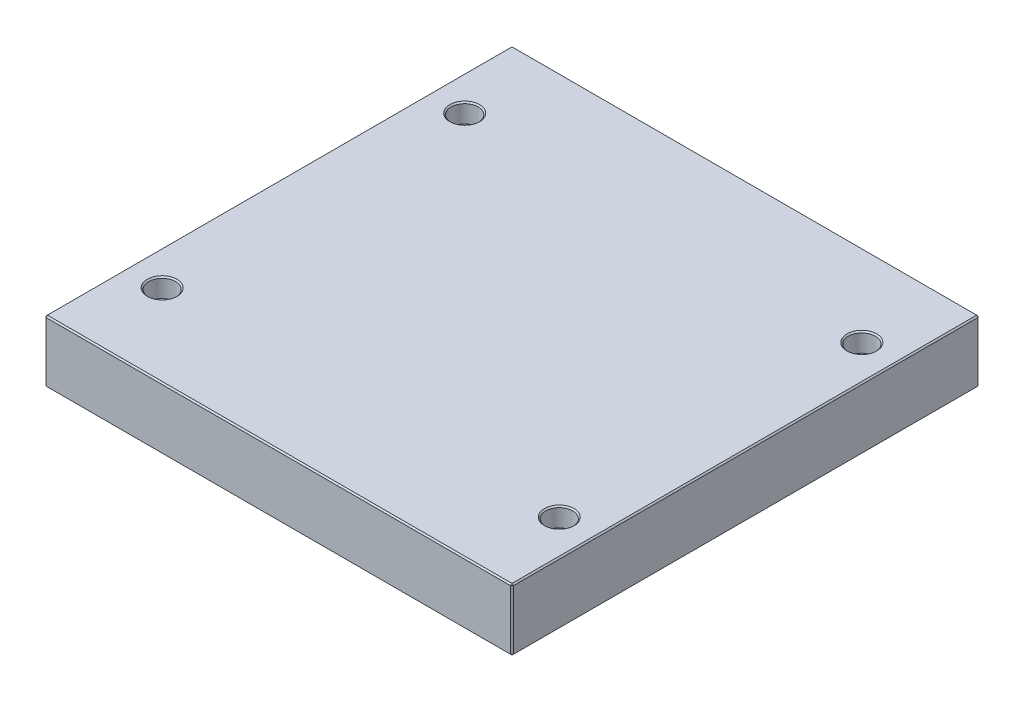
ISO-10303-21;
HEADER;
FILE_DESCRIPTION(('STEP AP214'),'2;1');
FILE_NAME('part.step','',(''),(''),'','','');
FILE_SCHEMA(('AUTOMOTIVE_DESIGN { 1 0 10303 214 1 1 1 1 }'));
ENDSEC;
DATA;
#1=APPLICATION_CONTEXT('core data for automotive mechanical design processes');
#2=APPLICATION_PROTOCOL_DEFINITION('international standard','automotive_design',2000,#1);
#3=PRODUCT_CONTEXT('',#1,'mechanical');
#4=PRODUCT('Part','Part','',(#3));
#5=PRODUCT_RELATED_PRODUCT_CATEGORY('part','',(#4));
#6=PRODUCT_DEFINITION_FORMATION('','',#4);
#7=PRODUCT_DEFINITION_CONTEXT('part definition',#1,'design');
#8=PRODUCT_DEFINITION('design','',#6,#7);
#9=PRODUCT_DEFINITION_SHAPE('','',#8);
#10=(LENGTH_UNIT() NAMED_UNIT(*) SI_UNIT(.MILLI.,.METRE.));
#11=(NAMED_UNIT(*) PLANE_ANGLE_UNIT() SI_UNIT($,.RADIAN.));
#12=(NAMED_UNIT(*) SI_UNIT($,.STERADIAN.) SOLID_ANGLE_UNIT());
#13=UNCERTAINTY_MEASURE_WITH_UNIT(LENGTH_MEASURE(1.E-05),#10,'distance_accuracy_value','');
#14=(GEOMETRIC_REPRESENTATION_CONTEXT(3) GLOBAL_UNCERTAINTY_ASSIGNED_CONTEXT((#13)) GLOBAL_UNIT_ASSIGNED_CONTEXT((#10,
#11,#12)) REPRESENTATION_CONTEXT('',''));
#15=CARTESIAN_POINT('',(0.,0.,0.));
#16=DIRECTION('',(0.,0.,1.));
#17=DIRECTION('',(1.,0.,0.));
#18=AXIS2_PLACEMENT_3D('',#15,#16,#17);
#19=CARTESIAN_POINT('',(-173.,46.,173.));
#20=DIRECTION('',(1.,0.,0.));
#21=DIRECTION('',(0.,0.,-1.));
#22=AXIS2_PLACEMENT_3D('',#19,#20,#21);
#23=PLANE('',#22);
#24=DIRECTION('',(0.,-1.,0.));
#25=VECTOR('',#24,1.);
#26=CARTESIAN_POINT('',(-173.,46.,-172.));
#27=LINE('',#26,#25);
#28=CARTESIAN_POINT('',(-173.,45.,-172.));
#29=VERTEX_POINT('',#28);
#30=CARTESIAN_POINT('',(-173.,1.,-172.));
#31=VERTEX_POINT('',#30);
#32=EDGE_CURVE('E115',#29,#31,#27,.T.);
#33=ORIENTED_EDGE('',*,*,#32,.T.);
#34=DIRECTION('',(0.,0.,1.));
#35=VECTOR('',#34,1.);
#36=CARTESIAN_POINT('',(-173.,1.,173.));
#37=LINE('',#36,#35);
#38=CARTESIAN_POINT('',(-173.,1.,172.));
#39=VERTEX_POINT('',#38);
#40=EDGE_CURVE('E111',#31,#39,#37,.T.);
#41=ORIENTED_EDGE('',*,*,#40,.T.);
#42=DIRECTION('',(0.,1.,0.));
#43=VECTOR('',#42,1.);
#44=CARTESIAN_POINT('',(-173.,46.,172.));
#45=LINE('',#44,#43);
#46=CARTESIAN_POINT('',(-173.,45.,172.));
#47=VERTEX_POINT('',#46);
#48=EDGE_CURVE('E104',#39,#47,#45,.T.);
#49=ORIENTED_EDGE('',*,*,#48,.T.);
#50=DIRECTION('',(0.,0.,-1.));
#51=VECTOR('',#50,1.);
#52=CARTESIAN_POINT('',(-173.,45.,-173.));
#53=LINE('',#52,#51);
#54=EDGE_CURVE('E108',#47,#29,#53,.T.);
#55=ORIENTED_EDGE('',*,*,#54,.T.);
#56=EDGE_LOOP('',(#33,#41,#49,#55));
#57=FACE_BOUND('',#56,.T.);
#58=ADVANCED_FACE('F16',(#57),#23,.F.);
#59=CARTESIAN_POINT('',(173.,46.,173.));
#60=DIRECTION('',(0.,0.,-1.));
#61=DIRECTION('',(-1.,0.,0.));
#62=AXIS2_PLACEMENT_3D('',#59,#60,#61);
#63=PLANE('',#62);
#64=DIRECTION('',(-1.,0.,0.));
#65=VECTOR('',#64,1.);
#66=CARTESIAN_POINT('',(-173.,45.,173.));
#67=LINE('',#66,#65);
#68=CARTESIAN_POINT('',(172.,45.,173.));
#69=VERTEX_POINT('',#68);
#70=CARTESIAN_POINT('',(-172.,45.,173.));
#71=VERTEX_POINT('',#70);
#72=EDGE_CURVE('E170',#69,#71,#67,.T.);
#73=ORIENTED_EDGE('',*,*,#72,.T.);
#74=DIRECTION('',(0.,-1.,0.));
#75=VECTOR('',#74,1.);
#76=CARTESIAN_POINT('',(-172.,46.,173.));
#77=LINE('',#76,#75);
#78=CARTESIAN_POINT('',(-172.,1.,173.));
#79=VERTEX_POINT('',#78);
#80=EDGE_CURVE('E123',#71,#79,#77,.T.);
#81=ORIENTED_EDGE('',*,*,#80,.T.);
#82=DIRECTION('',(1.,0.,0.));
#83=VECTOR('',#82,1.);
#84=CARTESIAN_POINT('',(173.,1.,173.));
#85=LINE('',#84,#83);
#86=CARTESIAN_POINT('',(172.,1.,173.));
#87=VERTEX_POINT('',#86);
#88=EDGE_CURVE('E174',#79,#87,#85,.T.);
#89=ORIENTED_EDGE('',*,*,#88,.T.);
#90=DIRECTION('',(0.,1.,0.));
#91=VECTOR('',#90,1.);
#92=CARTESIAN_POINT('',(172.,46.,173.));
#93=LINE('',#92,#91);
#94=EDGE_CURVE('E172',#87,#69,#93,.T.);
#95=ORIENTED_EDGE('',*,*,#94,.T.);
#96=EDGE_LOOP('',(#73,#81,#89,#95));
#97=FACE_BOUND('',#96,.T.);
#98=ADVANCED_FACE('F317',(#97),#63,.F.);
#99=CARTESIAN_POINT('',(173.,46.,173.));
#100=DIRECTION('',(-1.,0.,0.));
#101=DIRECTION('',(0.,0.,1.));
#102=AXIS2_PLACEMENT_3D('',#99,#100,#101);
#103=PLANE('',#102);
#104=DIRECTION('',(0.,0.,-1.));
#105=VECTOR('',#104,1.);
#106=CARTESIAN_POINT('',(173.,1.,173.));
#107=LINE('',#106,#105);
#108=CARTESIAN_POINT('',(173.,1.,172.));
#109=VERTEX_POINT('',#108);
#110=CARTESIAN_POINT('',(173.,1.,-172.));
#111=VERTEX_POINT('',#110);
#112=EDGE_CURVE('E165',#109,#111,#107,.T.);
#113=ORIENTED_EDGE('',*,*,#112,.T.);
#114=DIRECTION('',(0.,1.,0.));
#115=VECTOR('',#114,1.);
#116=CARTESIAN_POINT('',(173.,46.,-172.));
#117=LINE('',#116,#115);
#118=CARTESIAN_POINT('',(173.,45.,-172.));
#119=VERTEX_POINT('',#118);
#120=EDGE_CURVE('E167',#111,#119,#117,.T.);
#121=ORIENTED_EDGE('',*,*,#120,.T.);
#122=DIRECTION('',(0.,0.,1.));
#123=VECTOR('',#122,1.);
#124=CARTESIAN_POINT('',(173.,45.,173.));
#125=LINE('',#124,#123);
#126=CARTESIAN_POINT('',(173.,45.,172.));
#127=VERTEX_POINT('',#126);
#128=EDGE_CURVE('E161',#119,#127,#125,.T.);
#129=ORIENTED_EDGE('',*,*,#128,.T.);
#130=DIRECTION('',(0.,-1.,0.));
#131=VECTOR('',#130,1.);
#132=CARTESIAN_POINT('',(173.,46.,172.));
#133=LINE('',#132,#131);
#134=EDGE_CURVE('E163',#127,#109,#133,.T.);
#135=ORIENTED_EDGE('',*,*,#134,.T.);
#136=EDGE_LOOP('',(#113,#121,#129,#135));
#137=FACE_BOUND('',#136,.T.);
#138=ADVANCED_FACE('F323',(#137),#103,.F.);
#139=CARTESIAN_POINT('',(173.,46.,-173.));
#140=DIRECTION('',(0.,0.,1.));
#141=DIRECTION('',(1.,0.,0.));
#142=AXIS2_PLACEMENT_3D('',#139,#140,#141);
#143=PLANE('',#142);
#144=DIRECTION('',(0.,-1.,0.));
#145=VECTOR('',#144,1.);
#146=CARTESIAN_POINT('',(172.,46.,-173.));
#147=LINE('',#146,#145);
#148=CARTESIAN_POINT('',(172.,45.,-173.));
#149=VERTEX_POINT('',#148);
#150=CARTESIAN_POINT('',(172.,1.,-173.));
#151=VERTEX_POINT('',#150);
#152=EDGE_CURVE('E154',#149,#151,#147,.T.);
#153=ORIENTED_EDGE('',*,*,#152,.T.);
#154=DIRECTION('',(-1.,0.,0.));
#155=VECTOR('',#154,1.);
#156=CARTESIAN_POINT('',(173.,1.,-173.));
#157=LINE('',#156,#155);
#158=CARTESIAN_POINT('',(-172.,1.,-173.));
#159=VERTEX_POINT('',#158);
#160=EDGE_CURVE('E159',#151,#159,#157,.T.);
#161=ORIENTED_EDGE('',*,*,#160,.T.);
#162=DIRECTION('',(0.,1.,0.));
#163=VECTOR('',#162,1.);
#164=CARTESIAN_POINT('',(-172.,46.,-173.));
#165=LINE('',#164,#163);
#166=CARTESIAN_POINT('',(-172.,45.,-173.));
#167=VERTEX_POINT('',#166);
#168=EDGE_CURVE('E156',#159,#167,#165,.T.);
#169=ORIENTED_EDGE('',*,*,#168,.T.);
#170=DIRECTION('',(1.,0.,0.));
#171=VECTOR('',#170,1.);
#172=CARTESIAN_POINT('',(173.,45.,-173.));
#173=LINE('',#172,#171);
#174=EDGE_CURVE('E152',#167,#149,#173,.T.);
#175=ORIENTED_EDGE('',*,*,#174,.T.);
#176=EDGE_LOOP('',(#153,#161,#169,#175));
#177=FACE_BOUND('',#176,.T.);
#178=ADVANCED_FACE('F465',(#177),#143,.F.);
#179=CARTESIAN_POINT('',(0.,46.,0.));
#180=DIRECTION('',(0.,1.,0.));
#181=DIRECTION('',(0.,0.,1.));
#182=AXIS2_PLACEMENT_3D('',#179,#180,#181);
#183=PLANE('',#182);
#184=CARTESIAN_POINT('',(-147.,46.,112.));
#185=DIRECTION('',(0.,1.,0.));
#186=DIRECTION('',(0.,0.,1.));
#187=AXIS2_PLACEMENT_3D('',#184,#185,#186);
#188=CIRCLE('',#187,11.);
#189=CARTESIAN_POINT('',(-147.,46.,123.));
#190=VERTEX_POINT('',#189);
#191=EDGE_CURVE('E290',#190,#190,#188,.F.);
#192=ORIENTED_EDGE('',*,*,#191,.T.);
#193=EDGE_LOOP('',(#192));
#194=FACE_BOUND('',#193,.T.);
#195=CARTESIAN_POINT('',(147.,46.,112.));
#196=DIRECTION('',(0.,1.,0.));
#197=DIRECTION('',(0.,0.,1.));
#198=AXIS2_PLACEMENT_3D('',#195,#196,#197);
#199=CIRCLE('',#198,11.);
#200=CARTESIAN_POINT('',(147.,46.,123.));
#201=VERTEX_POINT('',#200);
#202=EDGE_CURVE('E287',#201,#201,#199,.F.);
#203=ORIENTED_EDGE('',*,*,#202,.T.);
#204=EDGE_LOOP('',(#203));
#205=FACE_BOUND('',#204,.T.);
#206=CARTESIAN_POINT('',(147.,46.,-112.));
#207=DIRECTION('',(0.,1.,0.));
#208=DIRECTION('',(0.,0.,1.));
#209=AXIS2_PLACEMENT_3D('',#206,#207,#208);
#210=CIRCLE('',#209,11.);
#211=CARTESIAN_POINT('',(147.,46.,-101.));
#212=VERTEX_POINT('',#211);
#213=EDGE_CURVE('E284',#212,#212,#210,.F.);
#214=ORIENTED_EDGE('',*,*,#213,.T.);
#215=EDGE_LOOP('',(#214));
#216=FACE_BOUND('',#215,.T.);
#217=CARTESIAN_POINT('',(-147.,46.,-112.));
#218=DIRECTION('',(0.,1.,0.));
#219=DIRECTION('',(0.,0.,1.));
#220=AXIS2_PLACEMENT_3D('',#217,#218,#219);
#221=CIRCLE('',#220,11.);
#222=CARTESIAN_POINT('',(-147.,46.,-101.));
#223=VERTEX_POINT('',#222);
#224=EDGE_CURVE('E281',#223,#223,#221,.F.);
#225=ORIENTED_EDGE('',*,*,#224,.T.);
#226=EDGE_LOOP('',(#225));
#227=FACE_BOUND('',#226,.T.);
#228=DIRECTION('',(0.,0.,-1.));
#229=VECTOR('',#228,1.);
#230=CARTESIAN_POINT('',(172.,46.,-173.));
#231=LINE('',#230,#229);
#232=CARTESIAN_POINT('',(172.,46.,172.));
#233=VERTEX_POINT('',#232);
#234=CARTESIAN_POINT('',(172.,46.,-172.));
#235=VERTEX_POINT('',#234);
#236=EDGE_CURVE('E31',#233,#235,#231,.T.);
#237=ORIENTED_EDGE('',*,*,#236,.T.);
#238=DIRECTION('',(-1.,0.,0.));
#239=VECTOR('',#238,1.);
#240=CARTESIAN_POINT('',(-173.,46.,-172.));
#241=LINE('',#240,#239);
#242=CARTESIAN_POINT('',(-172.,46.,-172.));
#243=VERTEX_POINT('',#242);
#244=EDGE_CURVE('E190',#235,#243,#241,.T.);
#245=ORIENTED_EDGE('',*,*,#244,.T.);
#246=DIRECTION('',(0.,0.,1.));
#247=VECTOR('',#246,1.);
#248=CARTESIAN_POINT('',(-172.,46.,173.));
#249=LINE('',#248,#247);
#250=CARTESIAN_POINT('',(-172.,46.,172.));
#251=VERTEX_POINT('',#250);
#252=EDGE_CURVE('E186',#243,#251,#249,.T.);
#253=ORIENTED_EDGE('',*,*,#252,.T.);
#254=DIRECTION('',(1.,0.,0.));
#255=VECTOR('',#254,1.);
#256=CARTESIAN_POINT('',(173.,46.,172.));
#257=LINE('',#256,#255);
#258=EDGE_CURVE('E36',#251,#233,#257,.T.);
#259=ORIENTED_EDGE('',*,*,#258,.T.);
#260=EDGE_LOOP('',(#237,#245,#253,#259));
#261=FACE_BOUND('',#260,.T.);
#262=ADVANCED_FACE('F462',(#194,#205,#216,#227,#261),#183,.T.);
#263=CARTESIAN_POINT('',(0.,0.,0.));
#264=DIRECTION('',(0.,1.,0.));
#265=DIRECTION('',(0.,0.,1.));
#266=AXIS2_PLACEMENT_3D('',#263,#264,#265);
#267=PLANE('',#266);
#268=CARTESIAN_POINT('',(147.,0.,-112.));
#269=DIRECTION('',(0.,1.,0.));
#270=DIRECTION('',(0.,0.,1.));
#271=AXIS2_PLACEMENT_3D('',#268,#269,#270);
#272=CIRCLE('',#271,8.);
#273=CARTESIAN_POINT('',(147.,0.,-104.));
#274=VERTEX_POINT('',#273);
#275=EDGE_CURVE('E263',#274,#274,#272,.T.);
#276=ORIENTED_EDGE('',*,*,#275,.T.);
#277=EDGE_LOOP('',(#276));
#278=FACE_BOUND('',#277,.T.);
#279=CARTESIAN_POINT('',(147.,0.,112.));
#280=DIRECTION('',(0.,1.,0.));
#281=DIRECTION('',(0.,0.,1.));
#282=AXIS2_PLACEMENT_3D('',#279,#280,#281);
#283=CIRCLE('',#282,8.);
#284=CARTESIAN_POINT('',(147.,0.,120.));
#285=VERTEX_POINT('',#284);
#286=EDGE_CURVE('E260',#285,#285,#283,.T.);
#287=ORIENTED_EDGE('',*,*,#286,.T.);
#288=EDGE_LOOP('',(#287));
#289=FACE_BOUND('',#288,.T.);
#290=CARTESIAN_POINT('',(-147.,0.,112.));
#291=DIRECTION('',(0.,1.,0.));
#292=DIRECTION('',(0.,0.,1.));
#293=AXIS2_PLACEMENT_3D('',#290,#291,#292);
#294=CIRCLE('',#293,8.);
#295=CARTESIAN_POINT('',(-147.,0.,120.));
#296=VERTEX_POINT('',#295);
#297=EDGE_CURVE('E257',#296,#296,#294,.T.);
#298=ORIENTED_EDGE('',*,*,#297,.T.);
#299=EDGE_LOOP('',(#298));
#300=FACE_BOUND('',#299,.T.);
#301=CARTESIAN_POINT('',(-147.,0.,-112.));
#302=DIRECTION('',(0.,1.,0.));
#303=DIRECTION('',(0.,0.,1.));
#304=AXIS2_PLACEMENT_3D('',#301,#302,#303);
#305=CIRCLE('',#304,8.);
#306=CARTESIAN_POINT('',(-147.,0.,-104.));
#307=VERTEX_POINT('',#306);
#308=EDGE_CURVE('E192',#307,#307,#305,.T.);
#309=ORIENTED_EDGE('',*,*,#308,.T.);
#310=EDGE_LOOP('',(#309));
#311=FACE_BOUND('',#310,.T.);
#312=DIRECTION('',(0.,0.,1.));
#313=VECTOR('',#312,1.);
#314=CARTESIAN_POINT('',(172.,0.,0.));
#315=LINE('',#314,#313);
#316=CARTESIAN_POINT('',(172.,0.,-172.));
#317=VERTEX_POINT('',#316);
#318=CARTESIAN_POINT('',(172.,0.,172.));
#319=VERTEX_POINT('',#318);
#320=EDGE_CURVE('E177',#317,#319,#315,.T.);
#321=ORIENTED_EDGE('',*,*,#320,.T.);
#322=DIRECTION('',(-1.,0.,0.));
#323=VECTOR('',#322,1.);
#324=CARTESIAN_POINT('',(0.,0.,172.));
#325=LINE('',#324,#323);
#326=CARTESIAN_POINT('',(-172.,0.,172.));
#327=VERTEX_POINT('',#326);
#328=EDGE_CURVE('E183',#319,#327,#325,.T.);
#329=ORIENTED_EDGE('',*,*,#328,.T.);
#330=DIRECTION('',(0.,0.,-1.));
#331=VECTOR('',#330,1.);
#332=CARTESIAN_POINT('',(-172.,0.,0.));
#333=LINE('',#332,#331);
#334=CARTESIAN_POINT('',(-172.,0.,-172.));
#335=VERTEX_POINT('',#334);
#336=EDGE_CURVE('E181',#327,#335,#333,.T.);
#337=ORIENTED_EDGE('',*,*,#336,.T.);
#338=DIRECTION('',(1.,0.,0.));
#339=VECTOR('',#338,1.);
#340=CARTESIAN_POINT('',(0.,0.,-172.));
#341=LINE('',#340,#339);
#342=EDGE_CURVE('E179',#335,#317,#341,.T.);
#343=ORIENTED_EDGE('',*,*,#342,.T.);
#344=EDGE_LOOP('',(#321,#329,#337,#343));
#345=FACE_BOUND('',#344,.T.);
#346=ADVANCED_FACE('F402',(#278,#289,#300,#311,#345),#267,.F.);
#347=CARTESIAN_POINT('',(173.,46.,172.));
#348=DIRECTION('',(-0.707106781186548,0.,-0.707106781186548));
#349=DIRECTION('',(0.,-1.,0.));
#350=AXIS2_PLACEMENT_3D('',#347,#348,#349);
#351=PLANE('',#350);
#352=DIRECTION('',(-0.707106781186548,0.,0.707106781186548));
#353=VECTOR('',#352,1.);
#354=CARTESIAN_POINT('',(172.,45.,173.));
#355=LINE('',#354,#353);
#356=EDGE_CURVE('E141',#69,#127,#355,.F.);
#357=ORIENTED_EDGE('',*,*,#356,.F.);
#358=ORIENTED_EDGE('',*,*,#94,.F.);
#359=DIRECTION('',(0.707106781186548,0.,-0.707106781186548));
#360=VECTOR('',#359,1.);
#361=CARTESIAN_POINT('',(172.,1.,173.));
#362=LINE('',#361,#360);
#363=EDGE_CURVE('E144',#109,#87,#362,.F.);
#364=ORIENTED_EDGE('',*,*,#363,.F.);
#365=ORIENTED_EDGE('',*,*,#134,.F.);
#366=EDGE_LOOP('',(#357,#358,#364,#365));
#367=FACE_BOUND('',#366,.T.);
#368=ADVANCED_FACE('F398',(#367),#351,.F.);
#369=CARTESIAN_POINT('',(172.,45.,173.));
#370=DIRECTION('',(0.577350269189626,0.577350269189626,0.577350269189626));
#371=DIRECTION('',(0.707106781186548,0.,-0.707106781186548));
#372=AXIS2_PLACEMENT_3D('',#369,#370,#371);
#373=PLANE('',#372);
#374=DIRECTION('',(0.,-0.707106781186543,0.707106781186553));
#375=VECTOR('',#374,1.);
#376=CARTESIAN_POINT('',(172.,45.,173.));
#377=LINE('',#376,#375);
#378=EDGE_CURVE('E235',#69,#233,#377,.F.);
#379=ORIENTED_EDGE('',*,*,#378,.F.);
#380=ORIENTED_EDGE('',*,*,#356,.T.);
#381=DIRECTION('',(-0.707106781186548,0.707106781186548,0.));
#382=VECTOR('',#381,1.);
#383=CARTESIAN_POINT('',(172.5,45.5,172.));
#384=LINE('',#383,#382);
#385=EDGE_CURVE('E237',#233,#127,#384,.F.);
#386=ORIENTED_EDGE('',*,*,#385,.F.);
#387=EDGE_LOOP('',(#379,#380,#386));
#388=FACE_BOUND('',#387,.T.);
#389=ADVANCED_FACE('F394',(#388),#373,.T.);
#390=CARTESIAN_POINT('',(172.,1.,173.));
#391=DIRECTION('',(0.57735026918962,-0.577350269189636,0.57735026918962));
#392=DIRECTION('',(0.,-0.707106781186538,-0.707106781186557));
#393=AXIS2_PLACEMENT_3D('',#390,#391,#392);
#394=PLANE('',#393);
#395=DIRECTION('',(-0.707106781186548,-0.707106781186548,0.));
#396=VECTOR('',#395,1.);
#397=CARTESIAN_POINT('',(172.5,0.500000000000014,172.));
#398=LINE('',#397,#396);
#399=EDGE_CURVE('E229',#109,#319,#398,.T.);
#400=ORIENTED_EDGE('',*,*,#399,.F.);
#401=ORIENTED_EDGE('',*,*,#363,.T.);
#402=DIRECTION('',(0.,0.707106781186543,0.707106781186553));
#403=VECTOR('',#402,1.);
#404=CARTESIAN_POINT('',(172.,1.,173.));
#405=LINE('',#404,#403);
#406=EDGE_CURVE('E232',#319,#87,#405,.T.);
#407=ORIENTED_EDGE('',*,*,#406,.F.);
#408=EDGE_LOOP('',(#400,#401,#407));
#409=FACE_BOUND('',#408,.T.);
#410=ADVANCED_FACE('F390',(#409),#394,.T.);
#411=CARTESIAN_POINT('',(172.,46.,0.));
#412=DIRECTION('',(0.707106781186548,0.707106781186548,0.));
#413=DIRECTION('',(0.,0.,1.));
#414=AXIS2_PLACEMENT_3D('',#411,#412,#413);
#415=PLANE('',#414);
#416=ORIENTED_EDGE('',*,*,#385,.T.);
#417=ORIENTED_EDGE('',*,*,#128,.F.);
#418=DIRECTION('',(0.707106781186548,-0.707106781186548,0.));
#419=VECTOR('',#418,1.);
#420=CARTESIAN_POINT('',(173.,45.,-172.));
#421=LINE('',#420,#419);
#422=EDGE_CURVE('E224',#235,#119,#421,.T.);
#423=ORIENTED_EDGE('',*,*,#422,.F.);
#424=ORIENTED_EDGE('',*,*,#236,.F.);
#425=EDGE_LOOP('',(#416,#417,#423,#424));
#426=FACE_BOUND('',#425,.T.);
#427=ADVANCED_FACE('F386',(#426),#415,.T.);
#428=CARTESIAN_POINT('',(0.,46.,172.));
#429=DIRECTION('',(0.,0.707106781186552,0.707106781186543));
#430=DIRECTION('',(-1.,0.,0.));
#431=AXIS2_PLACEMENT_3D('',#428,#429,#430);
#432=PLANE('',#431);
#433=ORIENTED_EDGE('',*,*,#378,.T.);
#434=ORIENTED_EDGE('',*,*,#258,.F.);
#435=DIRECTION('',(0.,0.707106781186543,-0.707106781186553));
#436=VECTOR('',#435,1.);
#437=CARTESIAN_POINT('',(-172.,45.5,172.5));
#438=LINE('',#437,#436);
#439=EDGE_CURVE('E127',#71,#251,#438,.T.);
#440=ORIENTED_EDGE('',*,*,#439,.F.);
#441=ORIENTED_EDGE('',*,*,#72,.F.);
#442=EDGE_LOOP('',(#433,#434,#440,#441));
#443=FACE_BOUND('',#442,.T.);
#444=ADVANCED_FACE('F383',(#443),#432,.T.);
#445=CARTESIAN_POINT('',(-172.,46.,173.));
#446=DIRECTION('',(0.707106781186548,0.,-0.707106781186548));
#447=DIRECTION('',(0.,-1.,0.));
#448=AXIS2_PLACEMENT_3D('',#445,#446,#447);
#449=PLANE('',#448);
#450=DIRECTION('',(0.707106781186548,0.,0.707106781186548));
#451=VECTOR('',#450,1.);
#452=CARTESIAN_POINT('',(-172.,1.,173.));
#453=LINE('',#452,#451);
#454=EDGE_CURVE('E128',#79,#39,#453,.F.);
#455=ORIENTED_EDGE('',*,*,#454,.F.);
#456=ORIENTED_EDGE('',*,*,#80,.F.);
#457=DIRECTION('',(-0.707106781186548,0.,-0.707106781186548));
#458=VECTOR('',#457,1.);
#459=CARTESIAN_POINT('',(-173.,45.,172.));
#460=LINE('',#459,#458);
#461=EDGE_CURVE('E119',#47,#71,#460,.F.);
#462=ORIENTED_EDGE('',*,*,#461,.F.);
#463=ORIENTED_EDGE('',*,*,#48,.F.);
#464=EDGE_LOOP('',(#455,#456,#462,#463));
#465=FACE_BOUND('',#464,.T.);
#466=ADVANCED_FACE('F121',(#465),#449,.F.);
#467=CARTESIAN_POINT('',(173.,1.,173.));
#468=DIRECTION('',(0.,0.707106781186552,-0.707106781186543));
#469=DIRECTION('',(1.,0.,0.));
#470=AXIS2_PLACEMENT_3D('',#467,#468,#469);
#471=PLANE('',#470);
#472=ORIENTED_EDGE('',*,*,#406,.T.);
#473=ORIENTED_EDGE('',*,*,#88,.F.);
#474=DIRECTION('',(0.,-0.707106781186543,-0.707106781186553));
#475=VECTOR('',#474,1.);
#476=CARTESIAN_POINT('',(-172.,1.,173.));
#477=LINE('',#476,#475);
#478=EDGE_CURVE('E220',#327,#79,#477,.F.);
#479=ORIENTED_EDGE('',*,*,#478,.F.);
#480=ORIENTED_EDGE('',*,*,#328,.F.);
#481=EDGE_LOOP('',(#472,#473,#479,#480));
#482=FACE_BOUND('',#481,.T.);
#483=ADVANCED_FACE('F376',(#482),#471,.F.);
#484=CARTESIAN_POINT('',(173.,1.,173.));
#485=DIRECTION('',(-0.707106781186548,0.707106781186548,0.));
#486=DIRECTION('',(0.,0.,-1.));
#487=AXIS2_PLACEMENT_3D('',#484,#485,#486);
#488=PLANE('',#487);
#489=ORIENTED_EDGE('',*,*,#399,.T.);
#490=ORIENTED_EDGE('',*,*,#320,.F.);
#491=DIRECTION('',(0.707106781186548,0.707106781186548,0.));
#492=VECTOR('',#491,1.);
#493=CARTESIAN_POINT('',(172.5,0.499999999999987,-172.));
#494=LINE('',#493,#492);
#495=EDGE_CURVE('E217',#111,#317,#494,.F.);
#496=ORIENTED_EDGE('',*,*,#495,.F.);
#497=ORIENTED_EDGE('',*,*,#112,.F.);
#498=EDGE_LOOP('',(#489,#490,#496,#497));
#499=FACE_BOUND('',#498,.T.);
#500=ADVANCED_FACE('F372',(#499),#488,.F.);
#501=CARTESIAN_POINT('',(172.,46.,-173.));
#502=DIRECTION('',(-0.707106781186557,0.,0.707106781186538));
#503=DIRECTION('',(0.,-1.,0.));
#504=AXIS2_PLACEMENT_3D('',#501,#502,#503);
#505=PLANE('',#504);
#506=DIRECTION('',(0.707106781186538,0.,0.707106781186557));
#507=VECTOR('',#506,1.);
#508=CARTESIAN_POINT('',(173.,45.,-172.));
#509=LINE('',#508,#507);
#510=EDGE_CURVE('E226',#119,#149,#509,.F.);
#511=ORIENTED_EDGE('',*,*,#510,.F.);
#512=ORIENTED_EDGE('',*,*,#120,.F.);
#513=DIRECTION('',(-0.707106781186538,0.,-0.707106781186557));
#514=VECTOR('',#513,1.);
#515=CARTESIAN_POINT('',(172.,1.,-173.));
#516=LINE('',#515,#514);
#517=EDGE_CURVE('E214',#151,#111,#516,.F.);
#518=ORIENTED_EDGE('',*,*,#517,.F.);
#519=ORIENTED_EDGE('',*,*,#152,.F.);
#520=EDGE_LOOP('',(#511,#512,#518,#519));
#521=FACE_BOUND('',#520,.T.);
#522=ADVANCED_FACE('F368',(#521),#505,.F.);
#523=CARTESIAN_POINT('',(173.,45.,-172.));
#524=DIRECTION('',(0.577350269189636,0.57735026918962,-0.57735026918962));
#525=DIRECTION('',(-0.707106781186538,0.,-0.707106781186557));
#526=AXIS2_PLACEMENT_3D('',#523,#524,#525);
#527=PLANE('',#526);
#528=ORIENTED_EDGE('',*,*,#422,.T.);
#529=ORIENTED_EDGE('',*,*,#510,.T.);
#530=DIRECTION('',(0.,0.707106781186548,0.707106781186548));
#531=VECTOR('',#530,1.);
#532=CARTESIAN_POINT('',(172.,45.5,-172.5));
#533=LINE('',#532,#531);
#534=EDGE_CURVE('E135',#235,#149,#533,.F.);
#535=ORIENTED_EDGE('',*,*,#534,.F.);
#536=EDGE_LOOP('',(#528,#529,#535));
#537=FACE_BOUND('',#536,.T.);
#538=ADVANCED_FACE('F365',(#537),#527,.T.);
#539=CARTESIAN_POINT('',(-173.,45.,172.));
#540=DIRECTION('',(-0.577350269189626,0.577350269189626,0.577350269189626));
#541=DIRECTION('',(0.707106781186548,0.,0.707106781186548));
#542=AXIS2_PLACEMENT_3D('',#539,#540,#541);
#543=PLANE('',#542);
#544=ORIENTED_EDGE('',*,*,#461,.T.);
#545=ORIENTED_EDGE('',*,*,#439,.T.);
#546=DIRECTION('',(-0.707106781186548,-0.707106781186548,0.));
#547=VECTOR('',#546,1.);
#548=CARTESIAN_POINT('',(-173.,45.,172.));
#549=LINE('',#548,#547);
#550=EDGE_CURVE('E131',#47,#251,#549,.F.);
#551=ORIENTED_EDGE('',*,*,#550,.F.);
#552=EDGE_LOOP('',(#544,#545,#551));
#553=FACE_BOUND('',#552,.T.);
#554=ADVANCED_FACE('F132',(#553),#543,.T.);
#555=CARTESIAN_POINT('',(-172.,1.,173.));
#556=DIRECTION('',(-0.57735026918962,-0.577350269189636,0.57735026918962));
#557=DIRECTION('',(0.,-0.707106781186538,-0.707106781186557));
#558=AXIS2_PLACEMENT_3D('',#555,#556,#557);
#559=PLANE('',#558);
#560=ORIENTED_EDGE('',*,*,#478,.T.);
#561=ORIENTED_EDGE('',*,*,#454,.T.);
#562=DIRECTION('',(-0.707106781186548,0.707106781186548,0.));
#563=VECTOR('',#562,1.);
#564=CARTESIAN_POINT('',(-172.5,0.500000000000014,172.));
#565=LINE('',#564,#563);
#566=EDGE_CURVE('E136',#327,#39,#565,.T.);
#567=ORIENTED_EDGE('',*,*,#566,.F.);
#568=EDGE_LOOP('',(#560,#561,#567));
#569=FACE_BOUND('',#568,.T.);
#570=ADVANCED_FACE('F358',(#569),#559,.T.);
#571=CARTESIAN_POINT('',(172.,1.,-173.));
#572=DIRECTION('',(0.577350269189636,-0.57735026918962,-0.57735026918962));
#573=DIRECTION('',(-0.707106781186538,0.,-0.707106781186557));
#574=AXIS2_PLACEMENT_3D('',#571,#572,#573);
#575=PLANE('',#574);
#576=ORIENTED_EDGE('',*,*,#517,.T.);
#577=ORIENTED_EDGE('',*,*,#495,.T.);
#578=DIRECTION('',(0.,-0.707106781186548,0.707106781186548));
#579=VECTOR('',#578,1.);
#580=CARTESIAN_POINT('',(172.,1.,-173.));
#581=LINE('',#580,#579);
#582=EDGE_CURVE('E207',#151,#317,#581,.T.);
#583=ORIENTED_EDGE('',*,*,#582,.F.);
#584=EDGE_LOOP('',(#576,#577,#583));
#585=FACE_BOUND('',#584,.T.);
#586=ADVANCED_FACE('F354',(#585),#575,.T.);
#587=CARTESIAN_POINT('',(0.,46.,-172.));
#588=DIRECTION('',(0.,0.707106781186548,-0.707106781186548));
#589=DIRECTION('',(1.,0.,0.));
#590=AXIS2_PLACEMENT_3D('',#587,#588,#589);
#591=PLANE('',#590);
#592=ORIENTED_EDGE('',*,*,#534,.T.);
#593=ORIENTED_EDGE('',*,*,#174,.F.);
#594=DIRECTION('',(0.,-0.707106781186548,-0.707106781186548));
#595=VECTOR('',#594,1.);
#596=CARTESIAN_POINT('',(-172.,45.,-173.));
#597=LINE('',#596,#595);
#598=EDGE_CURVE('E204',#243,#167,#597,.T.);
#599=ORIENTED_EDGE('',*,*,#598,.F.);
#600=ORIENTED_EDGE('',*,*,#244,.F.);
#601=EDGE_LOOP('',(#592,#593,#599,#600));
#602=FACE_BOUND('',#601,.T.);
#603=ADVANCED_FACE('F351',(#602),#591,.T.);
#604=CARTESIAN_POINT('',(-172.,46.,0.));
#605=DIRECTION('',(-0.707106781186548,0.707106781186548,0.));
#606=DIRECTION('',(0.,0.,-1.));
#607=AXIS2_PLACEMENT_3D('',#604,#605,#606);
#608=PLANE('',#607);
#609=ORIENTED_EDGE('',*,*,#550,.T.);
#610=ORIENTED_EDGE('',*,*,#252,.F.);
#611=DIRECTION('',(0.707106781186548,0.707106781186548,0.));
#612=VECTOR('',#611,1.);
#613=CARTESIAN_POINT('',(-172.5,45.5,-172.));
#614=LINE('',#613,#612);
#615=EDGE_CURVE('E139',#29,#243,#614,.T.);
#616=ORIENTED_EDGE('',*,*,#615,.F.);
#617=ORIENTED_EDGE('',*,*,#54,.F.);
#618=EDGE_LOOP('',(#609,#610,#616,#617));
#619=FACE_BOUND('',#618,.T.);
#620=ADVANCED_FACE('F138',(#619),#608,.T.);
#621=CARTESIAN_POINT('',(-173.,1.,173.));
#622=DIRECTION('',(0.707106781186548,0.707106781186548,0.));
#623=DIRECTION('',(0.,0.,1.));
#624=AXIS2_PLACEMENT_3D('',#621,#622,#623);
#625=PLANE('',#624);
#626=ORIENTED_EDGE('',*,*,#566,.T.);
#627=ORIENTED_EDGE('',*,*,#40,.F.);
#628=DIRECTION('',(0.707106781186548,-0.707106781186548,0.));
#629=VECTOR('',#628,1.);
#630=CARTESIAN_POINT('',(-173.,1.,-172.));
#631=LINE('',#630,#629);
#632=EDGE_CURVE('E200',#335,#31,#631,.F.);
#633=ORIENTED_EDGE('',*,*,#632,.F.);
#634=ORIENTED_EDGE('',*,*,#336,.F.);
#635=EDGE_LOOP('',(#626,#627,#633,#634));
#636=FACE_BOUND('',#635,.T.);
#637=ADVANCED_FACE('F344',(#636),#625,.F.);
#638=CARTESIAN_POINT('',(173.,1.,-173.));
#639=DIRECTION('',(0.,0.707106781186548,0.707106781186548));
#640=DIRECTION('',(-1.,0.,0.));
#641=AXIS2_PLACEMENT_3D('',#638,#639,#640);
#642=PLANE('',#641);
#643=ORIENTED_EDGE('',*,*,#582,.T.);
#644=ORIENTED_EDGE('',*,*,#342,.F.);
#645=DIRECTION('',(0.,0.707106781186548,-0.707106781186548));
#646=VECTOR('',#645,1.);
#647=CARTESIAN_POINT('',(-172.,0.5,-172.5));
#648=LINE('',#647,#646);
#649=EDGE_CURVE('E197',#159,#335,#648,.F.);
#650=ORIENTED_EDGE('',*,*,#649,.F.);
#651=ORIENTED_EDGE('',*,*,#160,.F.);
#652=EDGE_LOOP('',(#643,#644,#650,#651));
#653=FACE_BOUND('',#652,.T.);
#654=ADVANCED_FACE('F340',(#653),#642,.F.);
#655=CARTESIAN_POINT('',(-172.,45.,-173.));
#656=DIRECTION('',(-0.577350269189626,0.577350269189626,-0.577350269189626));
#657=DIRECTION('',(-0.707106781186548,0.,0.707106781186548));
#658=AXIS2_PLACEMENT_3D('',#655,#656,#657);
#659=PLANE('',#658);
#660=ORIENTED_EDGE('',*,*,#615,.T.);
#661=ORIENTED_EDGE('',*,*,#598,.T.);
#662=DIRECTION('',(0.707106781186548,0.,-0.707106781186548));
#663=VECTOR('',#662,1.);
#664=CARTESIAN_POINT('',(-172.,45.,-173.));
#665=LINE('',#664,#663);
#666=EDGE_CURVE('E195',#29,#167,#665,.T.);
#667=ORIENTED_EDGE('',*,*,#666,.F.);
#668=EDGE_LOOP('',(#660,#661,#667));
#669=FACE_BOUND('',#668,.T.);
#670=ADVANCED_FACE('F336',(#669),#659,.T.);
#671=CARTESIAN_POINT('',(-173.,1.,-172.));
#672=DIRECTION('',(-0.577350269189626,-0.577350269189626,-0.577350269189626));
#673=DIRECTION('',(-0.707106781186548,0.,0.707106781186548));
#674=AXIS2_PLACEMENT_3D('',#671,#672,#673);
#675=PLANE('',#674);
#676=ORIENTED_EDGE('',*,*,#649,.T.);
#677=ORIENTED_EDGE('',*,*,#632,.T.);
#678=DIRECTION('',(-0.707106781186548,0.,0.707106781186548));
#679=VECTOR('',#678,1.);
#680=CARTESIAN_POINT('',(-173.,1.,-172.));
#681=LINE('',#680,#679);
#682=EDGE_CURVE('E193',#159,#31,#681,.T.);
#683=ORIENTED_EDGE('',*,*,#682,.F.);
#684=EDGE_LOOP('',(#676,#677,#683));
#685=FACE_BOUND('',#684,.T.);
#686=ADVANCED_FACE('F332',(#685),#675,.T.);
#687=CARTESIAN_POINT('',(-173.,46.,-172.));
#688=DIRECTION('',(0.707106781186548,0.,0.707106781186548));
#689=DIRECTION('',(0.,-1.,0.));
#690=AXIS2_PLACEMENT_3D('',#687,#688,#689);
#691=PLANE('',#690);
#692=ORIENTED_EDGE('',*,*,#666,.T.);
#693=ORIENTED_EDGE('',*,*,#168,.F.);
#694=ORIENTED_EDGE('',*,*,#682,.T.);
#695=ORIENTED_EDGE('',*,*,#32,.F.);
#696=EDGE_LOOP('',(#692,#693,#694,#695));
#697=FACE_BOUND('',#696,.T.);
#698=ADVANCED_FACE('F328',(#697),#691,.F.);
#699=CARTESIAN_POINT('',(-147.,32.,-112.));
#700=DIRECTION('',(0.,1.,0.));
#701=DIRECTION('',(0.,0.,1.));
#702=AXIS2_PLACEMENT_3D('',#699,#700,#701);
#703=CYLINDRICAL_SURFACE('',#702,10.);
#704=CARTESIAN_POINT('',(-147.,45.,-112.));
#705=DIRECTION('',(0.,1.,0.));
#706=DIRECTION('',(0.,0.,1.));
#707=AXIS2_PLACEMENT_3D('',#704,#705,#706);
#708=CIRCLE('',#707,10.);
#709=CARTESIAN_POINT('',(-147.,45.,-102.));
#710=VERTEX_POINT('',#709);
#711=EDGE_CURVE('E10',#710,#710,#708,.T.);
#712=ORIENTED_EDGE('',*,*,#711,.T.);
#713=EDGE_LOOP('',(#712));
#714=FACE_BOUND('',#713,.T.);
#715=CARTESIAN_POINT('',(-147.,32.,-112.));
#716=DIRECTION('',(0.,1.,0.));
#717=DIRECTION('',(0.,0.,1.));
#718=AXIS2_PLACEMENT_3D('',#715,#716,#717);
#719=CIRCLE('',#718,10.);
#720=CARTESIAN_POINT('',(-147.,32.,-102.));
#721=VERTEX_POINT('',#720);
#722=EDGE_CURVE('E147',#721,#721,#719,.T.);
#723=ORIENTED_EDGE('',*,*,#722,.F.);
#724=EDGE_LOOP('',(#723));
#725=FACE_BOUND('',#724,.T.);
#726=ADVANCED_FACE('F331',(#714,#725),#703,.F.);
#727=CARTESIAN_POINT('',(-147.,32.,-112.));
#728=DIRECTION('',(0.,1.,0.));
#729=DIRECTION('',(0.,0.,1.));
#730=AXIS2_PLACEMENT_3D('',#727,#728,#729);
#731=PLANE('',#730);
#732=CARTESIAN_POINT('',(-147.,32.,-112.));
#733=DIRECTION('',(0.,1.,0.));
#734=DIRECTION('',(0.,0.,1.));
#735=AXIS2_PLACEMENT_3D('',#732,#733,#734);
#736=CIRCLE('',#735,7.);
#737=CARTESIAN_POINT('',(-147.,32.,-105.));
#738=VERTEX_POINT('',#737);
#739=EDGE_CURVE('E251',#738,#738,#736,.T.);
#740=ORIENTED_EDGE('',*,*,#739,.F.);
#741=EDGE_LOOP('',(#740));
#742=FACE_BOUND('',#741,.T.);
#743=ORIENTED_EDGE('',*,*,#722,.T.);
#744=EDGE_LOOP('',(#743));
#745=FACE_BOUND('',#744,.T.);
#746=ADVANCED_FACE('F450',(#742,#745),#731,.T.);
#747=CARTESIAN_POINT('',(147.,32.,-112.));
#748=DIRECTION('',(0.,1.,0.));
#749=DIRECTION('',(0.,0.,1.));
#750=AXIS2_PLACEMENT_3D('',#747,#748,#749);
#751=CYLINDRICAL_SURFACE('',#750,10.);
#752=CARTESIAN_POINT('',(147.,45.,-112.));
#753=DIRECTION('',(0.,1.,0.));
#754=DIRECTION('',(0.,0.,1.));
#755=AXIS2_PLACEMENT_3D('',#752,#753,#754);
#756=CIRCLE('',#755,10.);
#757=CARTESIAN_POINT('',(147.,45.,-102.));
#758=VERTEX_POINT('',#757);
#759=EDGE_CURVE('E24',#758,#758,#756,.T.);
#760=ORIENTED_EDGE('',*,*,#759,.T.);
#761=EDGE_LOOP('',(#760));
#762=FACE_BOUND('',#761,.T.);
#763=CARTESIAN_POINT('',(147.,32.,-112.));
#764=DIRECTION('',(0.,1.,0.));
#765=DIRECTION('',(0.,0.,1.));
#766=AXIS2_PLACEMENT_3D('',#763,#764,#765);
#767=CIRCLE('',#766,10.);
#768=CARTESIAN_POINT('',(147.,32.,-102.));
#769=VERTEX_POINT('',#768);
#770=EDGE_CURVE('E441',#769,#769,#767,.T.);
#771=ORIENTED_EDGE('',*,*,#770,.F.);
#772=EDGE_LOOP('',(#771));
#773=FACE_BOUND('',#772,.T.);
#774=ADVANCED_FACE('F298',(#762,#773),#751,.F.);
#775=CARTESIAN_POINT('',(147.,32.,-112.));
#776=DIRECTION('',(0.,1.,0.));
#777=DIRECTION('',(0.,0.,1.));
#778=AXIS2_PLACEMENT_3D('',#775,#776,#777);
#779=PLANE('',#778);
#780=CARTESIAN_POINT('',(147.,32.,-112.));
#781=DIRECTION('',(0.,1.,0.));
#782=DIRECTION('',(0.,0.,1.));
#783=AXIS2_PLACEMENT_3D('',#780,#781,#782);
#784=CIRCLE('',#783,7.);
#785=CARTESIAN_POINT('',(147.,32.,-105.));
#786=VERTEX_POINT('',#785);
#787=EDGE_CURVE('E248',#786,#786,#784,.T.);
#788=ORIENTED_EDGE('',*,*,#787,.F.);
#789=EDGE_LOOP('',(#788));
#790=FACE_BOUND('',#789,.T.);
#791=ORIENTED_EDGE('',*,*,#770,.T.);
#792=EDGE_LOOP('',(#791));
#793=FACE_BOUND('',#792,.T.);
#794=ADVANCED_FACE('F738',(#790,#793),#779,.T.);
#795=CARTESIAN_POINT('',(147.,32.,112.));
#796=DIRECTION('',(0.,1.,0.));
#797=DIRECTION('',(0.,0.,1.));
#798=AXIS2_PLACEMENT_3D('',#795,#796,#797);
#799=CYLINDRICAL_SURFACE('',#798,10.);
#800=CARTESIAN_POINT('',(147.,45.,112.));
#801=DIRECTION('',(0.,1.,0.));
#802=DIRECTION('',(0.,0.,1.));
#803=AXIS2_PLACEMENT_3D('',#800,#801,#802);
#804=CIRCLE('',#803,10.);
#805=CARTESIAN_POINT('',(147.,45.,122.));
#806=VERTEX_POINT('',#805);
#807=EDGE_CURVE('E293',#806,#806,#804,.T.);
#808=ORIENTED_EDGE('',*,*,#807,.T.);
#809=EDGE_LOOP('',(#808));
#810=FACE_BOUND('',#809,.T.);
#811=CARTESIAN_POINT('',(147.,32.,112.));
#812=DIRECTION('',(0.,1.,0.));
#813=DIRECTION('',(0.,0.,1.));
#814=AXIS2_PLACEMENT_3D('',#811,#812,#813);
#815=CIRCLE('',#814,10.);
#816=CARTESIAN_POINT('',(147.,32.,122.));
#817=VERTEX_POINT('',#816);
#818=EDGE_CURVE('E439',#817,#817,#815,.T.);
#819=ORIENTED_EDGE('',*,*,#818,.F.);
#820=EDGE_LOOP('',(#819));
#821=FACE_BOUND('',#820,.T.);
#822=ADVANCED_FACE('F730',(#810,#821),#799,.F.);
#823=CARTESIAN_POINT('',(147.,32.,112.));
#824=DIRECTION('',(0.,1.,0.));
#825=DIRECTION('',(0.,0.,1.));
#826=AXIS2_PLACEMENT_3D('',#823,#824,#825);
#827=PLANE('',#826);
#828=CARTESIAN_POINT('',(147.,32.,112.));
#829=DIRECTION('',(0.,1.,0.));
#830=DIRECTION('',(0.,0.,1.));
#831=AXIS2_PLACEMENT_3D('',#828,#829,#830);
#832=CIRCLE('',#831,7.);
#833=CARTESIAN_POINT('',(147.,32.,119.));
#834=VERTEX_POINT('',#833);
#835=EDGE_CURVE('E245',#834,#834,#832,.T.);
#836=ORIENTED_EDGE('',*,*,#835,.F.);
#837=EDGE_LOOP('',(#836));
#838=FACE_BOUND('',#837,.T.);
#839=ORIENTED_EDGE('',*,*,#818,.T.);
#840=EDGE_LOOP('',(#839));
#841=FACE_BOUND('',#840,.T.);
#842=ADVANCED_FACE('F434',(#838,#841),#827,.T.);
#843=CARTESIAN_POINT('',(-147.,32.,112.));
#844=DIRECTION('',(0.,1.,0.));
#845=DIRECTION('',(0.,0.,1.));
#846=AXIS2_PLACEMENT_3D('',#843,#844,#845);
#847=CYLINDRICAL_SURFACE('',#846,10.);
#848=CARTESIAN_POINT('',(-147.,45.,112.));
#849=DIRECTION('',(0.,1.,0.));
#850=DIRECTION('',(0.,0.,1.));
#851=AXIS2_PLACEMENT_3D('',#848,#849,#850);
#852=CIRCLE('',#851,10.);
#853=CARTESIAN_POINT('',(-147.,45.,122.));
#854=VERTEX_POINT('',#853);
#855=EDGE_CURVE('E278',#854,#854,#852,.T.);
#856=ORIENTED_EDGE('',*,*,#855,.T.);
#857=EDGE_LOOP('',(#856));
#858=FACE_BOUND('',#857,.T.);
#859=CARTESIAN_POINT('',(-147.,32.,112.));
#860=DIRECTION('',(0.,1.,0.));
#861=DIRECTION('',(0.,0.,1.));
#862=AXIS2_PLACEMENT_3D('',#859,#860,#861);
#863=CIRCLE('',#862,10.);
#864=CARTESIAN_POINT('',(-147.,32.,122.));
#865=VERTEX_POINT('',#864);
#866=EDGE_CURVE('E254',#865,#865,#863,.T.);
#867=ORIENTED_EDGE('',*,*,#866,.F.);
#868=EDGE_LOOP('',(#867));
#869=FACE_BOUND('',#868,.T.);
#870=ADVANCED_FACE('F430',(#858,#869),#847,.F.);
#871=CARTESIAN_POINT('',(-147.,32.,112.));
#872=DIRECTION('',(0.,1.,0.));
#873=DIRECTION('',(0.,0.,1.));
#874=AXIS2_PLACEMENT_3D('',#871,#872,#873);
#875=PLANE('',#874);
#876=CARTESIAN_POINT('',(-147.,32.,112.));
#877=DIRECTION('',(0.,1.,0.));
#878=DIRECTION('',(0.,0.,1.));
#879=AXIS2_PLACEMENT_3D('',#876,#877,#878);
#880=CIRCLE('',#879,7.);
#881=CARTESIAN_POINT('',(-147.,32.,119.));
#882=VERTEX_POINT('',#881);
#883=EDGE_CURVE('E242',#882,#882,#880,.T.);
#884=ORIENTED_EDGE('',*,*,#883,.F.);
#885=EDGE_LOOP('',(#884));
#886=FACE_BOUND('',#885,.T.);
#887=ORIENTED_EDGE('',*,*,#866,.T.);
#888=EDGE_LOOP('',(#887));
#889=FACE_BOUND('',#888,.T.);
#890=ADVANCED_FACE('F433',(#886,#889),#875,.T.);
#891=CARTESIAN_POINT('',(-147.,0.,112.));
#892=DIRECTION('',(0.,1.,0.));
#893=DIRECTION('',(0.,0.,1.));
#894=AXIS2_PLACEMENT_3D('',#891,#892,#893);
#895=CYLINDRICAL_SURFACE('',#894,7.);
#896=CARTESIAN_POINT('',(-147.,1.00000000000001,112.));
#897=DIRECTION('',(0.,1.,0.));
#898=DIRECTION('',(0.,0.,1.));
#899=AXIS2_PLACEMENT_3D('',#896,#897,#898);
#900=CIRCLE('',#899,7.);
#901=CARTESIAN_POINT('',(-147.,1.00000000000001,119.));
#902=VERTEX_POINT('',#901);
#903=EDGE_CURVE('E272',#902,#902,#900,.F.);
#904=ORIENTED_EDGE('',*,*,#903,.T.);
#905=EDGE_LOOP('',(#904));
#906=FACE_BOUND('',#905,.T.);
#907=ORIENTED_EDGE('',*,*,#883,.T.);
#908=EDGE_LOOP('',(#907));
#909=FACE_BOUND('',#908,.T.);
#910=ADVANCED_FACE('F705',(#906,#909),#895,.F.);
#911=CARTESIAN_POINT('',(147.,0.,112.));
#912=DIRECTION('',(0.,1.,0.));
#913=DIRECTION('',(0.,0.,1.));
#914=AXIS2_PLACEMENT_3D('',#911,#912,#913);
#915=CYLINDRICAL_SURFACE('',#914,7.);
#916=CARTESIAN_POINT('',(147.,0.999999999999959,112.));
#917=DIRECTION('',(0.,1.,0.));
#918=DIRECTION('',(0.,0.,1.));
#919=AXIS2_PLACEMENT_3D('',#916,#917,#918);
#920=CIRCLE('',#919,7.);
#921=CARTESIAN_POINT('',(147.,0.999999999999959,119.));
#922=VERTEX_POINT('',#921);
#923=EDGE_CURVE('E269',#922,#922,#920,.F.);
#924=ORIENTED_EDGE('',*,*,#923,.T.);
#925=EDGE_LOOP('',(#924));
#926=FACE_BOUND('',#925,.T.);
#927=ORIENTED_EDGE('',*,*,#835,.T.);
#928=EDGE_LOOP('',(#927));
#929=FACE_BOUND('',#928,.T.);
#930=ADVANCED_FACE('F697',(#926,#929),#915,.F.);
#931=CARTESIAN_POINT('',(147.,0.,-112.));
#932=DIRECTION('',(0.,1.,0.));
#933=DIRECTION('',(0.,0.,1.));
#934=AXIS2_PLACEMENT_3D('',#931,#932,#933);
#935=CYLINDRICAL_SURFACE('',#934,7.);
#936=CARTESIAN_POINT('',(147.,0.999999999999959,-112.));
#937=DIRECTION('',(0.,1.,0.));
#938=DIRECTION('',(0.,0.,1.));
#939=AXIS2_PLACEMENT_3D('',#936,#937,#938);
#940=CIRCLE('',#939,7.);
#941=CARTESIAN_POINT('',(147.,0.999999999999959,-105.));
#942=VERTEX_POINT('',#941);
#943=EDGE_CURVE('E266',#942,#942,#940,.F.);
#944=ORIENTED_EDGE('',*,*,#943,.T.);
#945=EDGE_LOOP('',(#944));
#946=FACE_BOUND('',#945,.T.);
#947=ORIENTED_EDGE('',*,*,#787,.T.);
#948=EDGE_LOOP('',(#947));
#949=FACE_BOUND('',#948,.T.);
#950=ADVANCED_FACE('F688',(#946,#949),#935,.F.);
#951=CARTESIAN_POINT('',(-147.,0.,-112.));
#952=DIRECTION('',(0.,1.,0.));
#953=DIRECTION('',(0.,0.,1.));
#954=AXIS2_PLACEMENT_3D('',#951,#952,#953);
#955=CYLINDRICAL_SURFACE('',#954,7.);
#956=CARTESIAN_POINT('',(-147.,1.00000000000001,-112.));
#957=DIRECTION('',(0.,1.,0.));
#958=DIRECTION('',(0.,0.,1.));
#959=AXIS2_PLACEMENT_3D('',#956,#957,#958);
#960=CIRCLE('',#959,7.);
#961=CARTESIAN_POINT('',(-147.,1.00000000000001,-105.));
#962=VERTEX_POINT('',#961);
#963=EDGE_CURVE('E275',#962,#962,#960,.F.);
#964=ORIENTED_EDGE('',*,*,#963,.T.);
#965=EDGE_LOOP('',(#964));
#966=FACE_BOUND('',#965,.T.);
#967=ORIENTED_EDGE('',*,*,#739,.T.);
#968=EDGE_LOOP('',(#967));
#969=FACE_BOUND('',#968,.T.);
#970=ADVANCED_FACE('F408',(#966,#969),#955,.F.);
#971=CARTESIAN_POINT('',(147.,0.,-112.));
#972=DIRECTION('',(0.,-1.,0.));
#973=DIRECTION('',(0.,0.,-1.));
#974=AXIS2_PLACEMENT_3D('',#971,#972,#973);
#975=CONICAL_SURFACE('',#974,8.,0.785398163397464);
#976=ORIENTED_EDGE('',*,*,#943,.F.);
#977=EDGE_LOOP('',(#976));
#978=FACE_BOUND('',#977,.T.);
#979=ORIENTED_EDGE('',*,*,#275,.F.);
#980=EDGE_LOOP('',(#979));
#981=FACE_BOUND('',#980,.T.);
#982=ADVANCED_FACE('F404',(#978,#981),#975,.F.);
#983=CARTESIAN_POINT('',(147.,0.,112.));
#984=DIRECTION('',(0.,-1.,0.));
#985=DIRECTION('',(0.,0.,-1.));
#986=AXIS2_PLACEMENT_3D('',#983,#984,#985);
#987=CONICAL_SURFACE('',#986,8.,0.785398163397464);
#988=ORIENTED_EDGE('',*,*,#923,.F.);
#989=EDGE_LOOP('',(#988));
#990=FACE_BOUND('',#989,.T.);
#991=ORIENTED_EDGE('',*,*,#286,.F.);
#992=EDGE_LOOP('',(#991));
#993=FACE_BOUND('',#992,.T.);
#994=ADVANCED_FACE('F407',(#990,#993),#987,.F.);
#995=CARTESIAN_POINT('',(-147.,0.,112.));
#996=DIRECTION('',(0.,-1.,0.));
#997=DIRECTION('',(0.,0.,-1.));
#998=AXIS2_PLACEMENT_3D('',#995,#996,#997);
#999=CONICAL_SURFACE('',#998,8.,0.785398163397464);
#1000=ORIENTED_EDGE('',*,*,#903,.F.);
#1001=EDGE_LOOP('',(#1000));
#1002=FACE_BOUND('',#1001,.T.);
#1003=ORIENTED_EDGE('',*,*,#297,.F.);
#1004=EDGE_LOOP('',(#1003));
#1005=FACE_BOUND('',#1004,.T.);
#1006=ADVANCED_FACE('F412',(#1002,#1005),#999,.F.);
#1007=CARTESIAN_POINT('',(-147.,0.,-112.));
#1008=DIRECTION('',(0.,-1.,0.));
#1009=DIRECTION('',(0.,0.,-1.));
#1010=AXIS2_PLACEMENT_3D('',#1007,#1008,#1009);
#1011=CONICAL_SURFACE('',#1010,8.,0.785398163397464);
#1012=ORIENTED_EDGE('',*,*,#963,.F.);
#1013=EDGE_LOOP('',(#1012));
#1014=FACE_BOUND('',#1013,.T.);
#1015=ORIENTED_EDGE('',*,*,#308,.F.);
#1016=EDGE_LOOP('',(#1015));
#1017=FACE_BOUND('',#1016,.T.);
#1018=ADVANCED_FACE('F416',(#1014,#1017),#1011,.F.);
#1019=CARTESIAN_POINT('',(-147.,45.,112.));
#1020=DIRECTION('',(0.,1.,0.));
#1021=DIRECTION('',(0.,0.,1.));
#1022=AXIS2_PLACEMENT_3D('',#1019,#1020,#1021);
#1023=CONICAL_SURFACE('',#1022,10.,0.78539816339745);
#1024=ORIENTED_EDGE('',*,*,#191,.F.);
#1025=EDGE_LOOP('',(#1024));
#1026=FACE_BOUND('',#1025,.T.);
#1027=ORIENTED_EDGE('',*,*,#855,.F.);
#1028=EDGE_LOOP('',(#1027));
#1029=FACE_BOUND('',#1028,.T.);
#1030=ADVANCED_FACE('F312',(#1026,#1029),#1023,.F.);
#1031=CARTESIAN_POINT('',(147.,45.,112.));
#1032=DIRECTION('',(0.,1.,0.));
#1033=DIRECTION('',(0.,0.,1.));
#1034=AXIS2_PLACEMENT_3D('',#1031,#1032,#1033);
#1035=CONICAL_SURFACE('',#1034,10.,0.78539816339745);
#1036=ORIENTED_EDGE('',*,*,#202,.F.);
#1037=EDGE_LOOP('',(#1036));
#1038=FACE_BOUND('',#1037,.T.);
#1039=ORIENTED_EDGE('',*,*,#807,.F.);
#1040=EDGE_LOOP('',(#1039));
#1041=FACE_BOUND('',#1040,.T.);
#1042=ADVANCED_FACE('F303',(#1038,#1041),#1035,.F.);
#1043=CARTESIAN_POINT('',(147.,45.,-112.));
#1044=DIRECTION('',(0.,1.,0.));
#1045=DIRECTION('',(0.,0.,1.));
#1046=AXIS2_PLACEMENT_3D('',#1043,#1044,#1045);
#1047=CONICAL_SURFACE('',#1046,10.,0.78539816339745);
#1048=ORIENTED_EDGE('',*,*,#213,.F.);
#1049=EDGE_LOOP('',(#1048));
#1050=FACE_BOUND('',#1049,.T.);
#1051=ORIENTED_EDGE('',*,*,#759,.F.);
#1052=EDGE_LOOP('',(#1051));
#1053=FACE_BOUND('',#1052,.T.);
#1054=ADVANCED_FACE('F301',(#1050,#1053),#1047,.F.);
#1055=CARTESIAN_POINT('',(-147.,45.,-112.));
#1056=DIRECTION('',(0.,1.,0.));
#1057=DIRECTION('',(0.,0.,1.));
#1058=AXIS2_PLACEMENT_3D('',#1055,#1056,#1057);
#1059=CONICAL_SURFACE('',#1058,10.,0.78539816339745);
#1060=ORIENTED_EDGE('',*,*,#224,.F.);
#1061=EDGE_LOOP('',(#1060));
#1062=FACE_BOUND('',#1061,.T.);
#1063=ORIENTED_EDGE('',*,*,#711,.F.);
#1064=EDGE_LOOP('',(#1063));
#1065=FACE_BOUND('',#1064,.T.);
#1066=ADVANCED_FACE('F18',(#1062,#1065),#1059,.F.);
#1067=CLOSED_SHELL('',(#58,#98,#138,#178,#262,#346,#368,#389,#410,#427,#444,#466,#483,#500,#522,
#538,#554,#570,#586,#603,#620,#637,#654,#670,#686,#698,#726,#746,#774,#794,#822,#842,#870,#890,
#910,#930,#950,#970,#982,#994,#1006,#1018,#1030,#1042,#1054,#1066));
#1068=MANIFOLD_SOLID_BREP('B1',#1067);
#1069=ADVANCED_BREP_SHAPE_REPRESENTATION('',(#18,#1068),#14);
#1070=SHAPE_DEFINITION_REPRESENTATION(#9,#1069);
ENDSEC;
END-ISO-10303-21;
